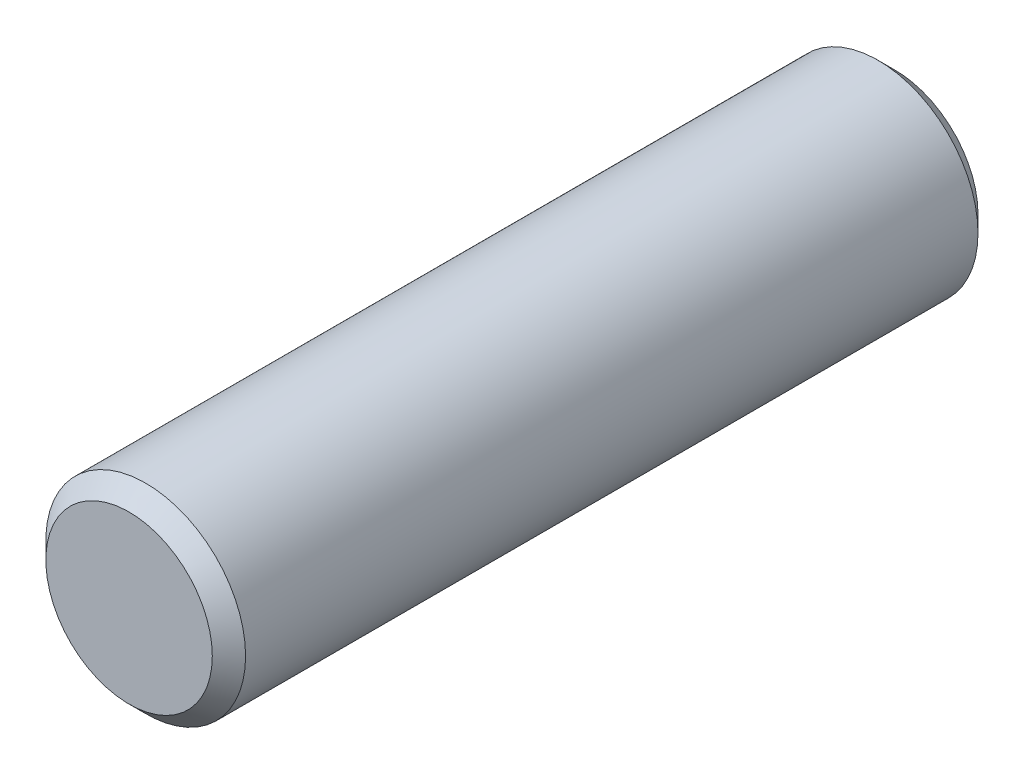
ISO-10303-21;
HEADER;
FILE_DESCRIPTION(('STEP AP214'),'2;1');
FILE_NAME('part.step','',(''),(''),'','','');
FILE_SCHEMA(('AUTOMOTIVE_DESIGN { 1 0 10303 214 1 1 1 1 }'));
ENDSEC;
DATA;
#1=APPLICATION_CONTEXT('core data for automotive mechanical design processes');
#2=APPLICATION_PROTOCOL_DEFINITION('international standard','automotive_design',2000,#1);
#3=PRODUCT_CONTEXT('',#1,'mechanical');
#4=PRODUCT('Part','Part','',(#3));
#5=PRODUCT_RELATED_PRODUCT_CATEGORY('part','',(#4));
#6=PRODUCT_DEFINITION_FORMATION('','',#4);
#7=PRODUCT_DEFINITION_CONTEXT('part definition',#1,'design');
#8=PRODUCT_DEFINITION('design','',#6,#7);
#9=PRODUCT_DEFINITION_SHAPE('','',#8);
#10=(LENGTH_UNIT() NAMED_UNIT(*) SI_UNIT(.MILLI.,.METRE.));
#11=(NAMED_UNIT(*) PLANE_ANGLE_UNIT() SI_UNIT($,.RADIAN.));
#12=(NAMED_UNIT(*) SI_UNIT($,.STERADIAN.) SOLID_ANGLE_UNIT());
#13=UNCERTAINTY_MEASURE_WITH_UNIT(LENGTH_MEASURE(1.E-05),#10,'distance_accuracy_value','');
#14=(GEOMETRIC_REPRESENTATION_CONTEXT(3) GLOBAL_UNCERTAINTY_ASSIGNED_CONTEXT((#13)) GLOBAL_UNIT_ASSIGNED_CONTEXT((#10,
#11,#12)) REPRESENTATION_CONTEXT('',''));
#15=CARTESIAN_POINT('',(0.,0.,0.));
#16=DIRECTION('',(0.,0.,1.));
#17=DIRECTION('',(1.,0.,0.));
#18=AXIS2_PLACEMENT_3D('',#15,#16,#17);
#19=CARTESIAN_POINT('',(0.,0.,46.));
#20=DIRECTION('',(0.,0.,-1.));
#21=DIRECTION('',(-1.,0.,0.));
#22=AXIS2_PLACEMENT_3D('',#19,#20,#21);
#23=CYLINDRICAL_SURFACE('',#22,6.);
#24=CARTESIAN_POINT('',(0.,0.,45.));
#25=DIRECTION('',(0.,0.,1.));
#26=DIRECTION('',(1.,0.,0.));
#27=AXIS2_PLACEMENT_3D('',#24,#25,#26);
#28=CIRCLE('',#27,6.);
#29=CARTESIAN_POINT('',(6.00000000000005,0.,45.));
#30=VERTEX_POINT('',#29);
#31=EDGE_CURVE('E28',#30,#30,#28,.F.);
#32=ORIENTED_EDGE('',*,*,#31,.T.);
#33=EDGE_LOOP('',(#32));
#34=FACE_BOUND('',#33,.T.);
#35=CARTESIAN_POINT('',(0.,0.,1.));
#36=DIRECTION('',(0.,0.,1.));
#37=DIRECTION('',(1.,0.,0.));
#38=AXIS2_PLACEMENT_3D('',#35,#36,#37);
#39=CIRCLE('',#38,6.);
#40=CARTESIAN_POINT('',(6.00000000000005,0.,1.));
#41=VERTEX_POINT('',#40);
#42=EDGE_CURVE('E32',#41,#41,#39,.T.);
#43=ORIENTED_EDGE('',*,*,#42,.T.);
#44=EDGE_LOOP('',(#43));
#45=FACE_BOUND('',#44,.T.);
#46=ADVANCED_FACE('F22',(#34,#45),#23,.T.);
#47=CARTESIAN_POINT('',(0.,0.,46.));
#48=DIRECTION('',(0.,0.,1.));
#49=DIRECTION('',(1.,0.,0.));
#50=AXIS2_PLACEMENT_3D('',#47,#48,#49);
#51=PLANE('',#50);
#52=CARTESIAN_POINT('',(0.,0.,46.));
#53=DIRECTION('',(0.,0.,1.));
#54=DIRECTION('',(1.,0.,0.));
#55=AXIS2_PLACEMENT_3D('',#52,#53,#54);
#56=CIRCLE('',#55,5.);
#57=CARTESIAN_POINT('',(5.00000000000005,0.,46.));
#58=VERTEX_POINT('',#57);
#59=EDGE_CURVE('E36',#58,#58,#56,.T.);
#60=ORIENTED_EDGE('',*,*,#59,.T.);
#61=EDGE_LOOP('',(#60));
#62=FACE_BOUND('',#61,.T.);
#63=ADVANCED_FACE('F42',(#62),#51,.T.);
#64=CARTESIAN_POINT('',(0.,0.,0.));
#65=DIRECTION('',(0.,0.,1.));
#66=DIRECTION('',(1.,0.,0.));
#67=AXIS2_PLACEMENT_3D('',#64,#65,#66);
#68=PLANE('',#67);
#69=CARTESIAN_POINT('',(0.,0.,0.));
#70=DIRECTION('',(0.,0.,1.));
#71=DIRECTION('',(1.,0.,0.));
#72=AXIS2_PLACEMENT_3D('',#69,#70,#71);
#73=CIRCLE('',#72,4.99999999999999);
#74=CARTESIAN_POINT('',(5.00000000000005,0.,0.));
#75=VERTEX_POINT('',#74);
#76=EDGE_CURVE('E10',#75,#75,#73,.F.);
#77=ORIENTED_EDGE('',*,*,#76,.T.);
#78=EDGE_LOOP('',(#77));
#79=FACE_BOUND('',#78,.T.);
#80=ADVANCED_FACE('F47',(#79),#68,.F.);
#81=CARTESIAN_POINT('',(0.,0.,46.));
#82=DIRECTION('',(0.,0.,-1.));
#83=DIRECTION('',(-1.,0.,0.));
#84=AXIS2_PLACEMENT_3D('',#81,#82,#83);
#85=CONICAL_SURFACE('',#84,5.,0.785398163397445);
#86=ORIENTED_EDGE('',*,*,#31,.F.);
#87=EDGE_LOOP('',(#86));
#88=FACE_BOUND('',#87,.T.);
#89=ORIENTED_EDGE('',*,*,#59,.F.);
#90=EDGE_LOOP('',(#89));
#91=FACE_BOUND('',#90,.T.);
#92=ADVANCED_FACE('F44',(#88,#91),#85,.T.);
#93=CARTESIAN_POINT('',(0.,0.,1.));
#94=DIRECTION('',(0.,0.,1.));
#95=DIRECTION('',(1.,0.,0.));
#96=AXIS2_PLACEMENT_3D('',#93,#94,#95);
#97=CONICAL_SURFACE('',#96,6.,0.78539816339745);
#98=ORIENTED_EDGE('',*,*,#76,.F.);
#99=EDGE_LOOP('',(#98));
#100=FACE_BOUND('',#99,.T.);
#101=ORIENTED_EDGE('',*,*,#42,.F.);
#102=EDGE_LOOP('',(#101));
#103=FACE_BOUND('',#102,.T.);
#104=ADVANCED_FACE('F46',(#100,#103),#97,.T.);
#105=CLOSED_SHELL('',(#46,#63,#80,#92,#104));
#106=MANIFOLD_SOLID_BREP('B2',#105);
#107=ADVANCED_BREP_SHAPE_REPRESENTATION('',(#18,#106),#14);
#108=SHAPE_DEFINITION_REPRESENTATION(#9,#107);
ENDSEC;
END-ISO-10303-21;
